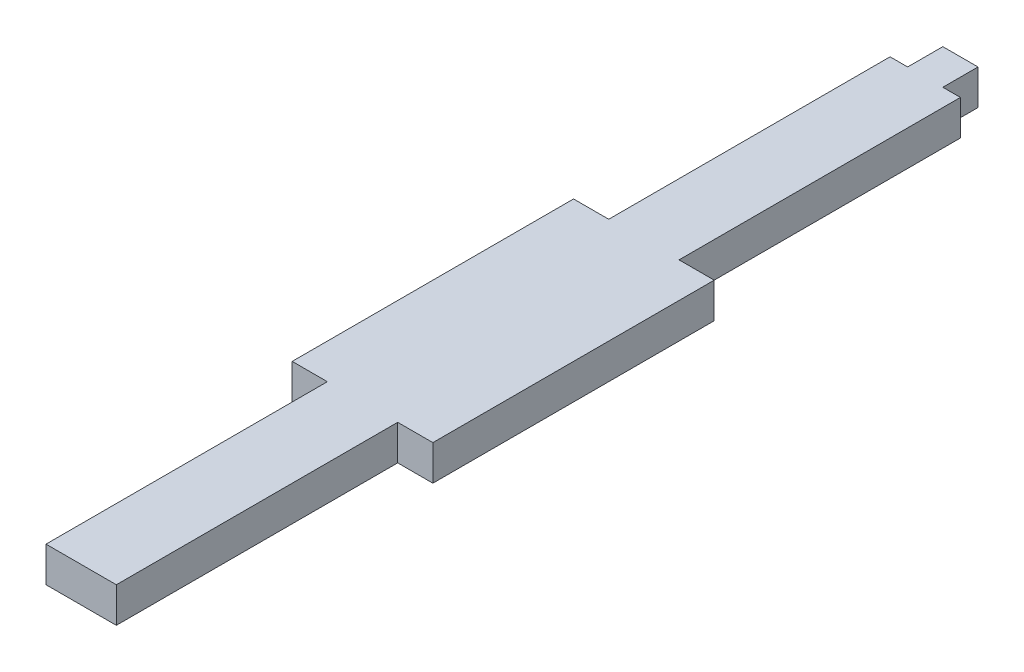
ISO-10303-21;
HEADER;
FILE_DESCRIPTION(('STEP AP214'),'2;1');
FILE_NAME('part.step','',(''),(''),'','','');
FILE_SCHEMA(('AUTOMOTIVE_DESIGN { 1 0 10303 214 1 1 1 1 }'));
ENDSEC;
DATA;
#1=APPLICATION_CONTEXT('core data for automotive mechanical design processes');
#2=APPLICATION_PROTOCOL_DEFINITION('international standard','automotive_design',2000,#1);
#3=PRODUCT_CONTEXT('',#1,'mechanical');
#4=PRODUCT('Part','Part','',(#3));
#5=PRODUCT_RELATED_PRODUCT_CATEGORY('part','',(#4));
#6=PRODUCT_DEFINITION_FORMATION('','',#4);
#7=PRODUCT_DEFINITION_CONTEXT('part definition',#1,'design');
#8=PRODUCT_DEFINITION('design','',#6,#7);
#9=PRODUCT_DEFINITION_SHAPE('','',#8);
#10=(LENGTH_UNIT() NAMED_UNIT(*) SI_UNIT(.MILLI.,.METRE.));
#11=(NAMED_UNIT(*) PLANE_ANGLE_UNIT() SI_UNIT($,.RADIAN.));
#12=(NAMED_UNIT(*) SI_UNIT($,.STERADIAN.) SOLID_ANGLE_UNIT());
#13=UNCERTAINTY_MEASURE_WITH_UNIT(LENGTH_MEASURE(1.E-05),#10,'distance_accuracy_value','');
#14=(GEOMETRIC_REPRESENTATION_CONTEXT(3) GLOBAL_UNCERTAINTY_ASSIGNED_CONTEXT((#13)) GLOBAL_UNIT_ASSIGNED_CONTEXT((#10,
#11,#12)) REPRESENTATION_CONTEXT('',''));
#15=CARTESIAN_POINT('',(0.,0.,0.));
#16=DIRECTION('',(0.,0.,1.));
#17=DIRECTION('',(1.,0.,0.));
#18=AXIS2_PLACEMENT_3D('',#15,#16,#17);
#19=CARTESIAN_POINT('',(3.175,3.175,79.375));
#20=DIRECTION('',(-1.,0.,0.));
#21=DIRECTION('',(0.,0.,1.));
#22=AXIS2_PLACEMENT_3D('',#19,#20,#21);
#23=PLANE('',#22);
#24=DIRECTION('',(0.,0.,-1.));
#25=VECTOR('',#24,1.);
#26=CARTESIAN_POINT('',(3.175,0.,79.375));
#27=LINE('',#26,#25);
#28=CARTESIAN_POINT('',(3.175,0.,79.375));
#29=VERTEX_POINT('',#28);
#30=CARTESIAN_POINT('',(3.175,0.,53.975));
#31=VERTEX_POINT('',#30);
#32=EDGE_CURVE('E176',#29,#31,#27,.T.);
#33=ORIENTED_EDGE('',*,*,#32,.T.);
#34=DIRECTION('',(0.,-1.,0.));
#35=VECTOR('',#34,1.);
#36=CARTESIAN_POINT('',(3.175,3.175,53.975));
#37=LINE('',#36,#35);
#38=CARTESIAN_POINT('',(3.175,3.175,53.975));
#39=VERTEX_POINT('',#38);
#40=EDGE_CURVE('E11',#39,#31,#37,.T.);
#41=ORIENTED_EDGE('',*,*,#40,.F.);
#42=DIRECTION('',(0.,0.,-1.));
#43=VECTOR('',#42,1.);
#44=CARTESIAN_POINT('',(3.175,3.175,79.375));
#45=LINE('',#44,#43);
#46=CARTESIAN_POINT('',(3.175,3.175,79.375));
#47=VERTEX_POINT('',#46);
#48=EDGE_CURVE('E207',#47,#39,#45,.T.);
#49=ORIENTED_EDGE('',*,*,#48,.F.);
#50=DIRECTION('',(0.,-1.,0.));
#51=VECTOR('',#50,1.);
#52=CARTESIAN_POINT('',(3.175,3.175,79.375));
#53=LINE('',#52,#51);
#54=EDGE_CURVE('E172',#47,#29,#53,.T.);
#55=ORIENTED_EDGE('',*,*,#54,.T.);
#56=EDGE_LOOP('',(#33,#41,#49,#55));
#57=FACE_BOUND('',#56,.T.);
#58=ADVANCED_FACE('F32',(#57),#23,.F.);
#59=CARTESIAN_POINT('',(6.35,3.175,53.975));
#60=DIRECTION('',(0.,0.,-1.));
#61=DIRECTION('',(-1.,0.,0.));
#62=AXIS2_PLACEMENT_3D('',#59,#60,#61);
#63=PLANE('',#62);
#64=DIRECTION('',(1.,0.,0.));
#65=VECTOR('',#64,1.);
#66=CARTESIAN_POINT('',(6.35,0.,53.975));
#67=LINE('',#66,#65);
#68=CARTESIAN_POINT('',(6.35,0.,53.975));
#69=VERTEX_POINT('',#68);
#70=EDGE_CURVE('E179',#31,#69,#67,.T.);
#71=ORIENTED_EDGE('',*,*,#70,.T.);
#72=DIRECTION('',(0.,-1.,0.));
#73=VECTOR('',#72,1.);
#74=CARTESIAN_POINT('',(6.35,3.175,53.975));
#75=LINE('',#74,#73);
#76=CARTESIAN_POINT('',(6.35,3.175,53.975));
#77=VERTEX_POINT('',#76);
#78=EDGE_CURVE('E40',#77,#69,#75,.T.);
#79=ORIENTED_EDGE('',*,*,#78,.F.);
#80=DIRECTION('',(1.,0.,0.));
#81=VECTOR('',#80,1.);
#82=CARTESIAN_POINT('',(6.35,3.175,53.975));
#83=LINE('',#82,#81);
#84=EDGE_CURVE('E115',#39,#77,#83,.T.);
#85=ORIENTED_EDGE('',*,*,#84,.F.);
#86=ORIENTED_EDGE('',*,*,#40,.T.);
#87=EDGE_LOOP('',(#71,#79,#85,#86));
#88=FACE_BOUND('',#87,.T.);
#89=ADVANCED_FACE('F305',(#88),#63,.F.);
#90=CARTESIAN_POINT('',(6.35,3.175,53.975));
#91=DIRECTION('',(-1.,0.,0.));
#92=DIRECTION('',(0.,0.,1.));
#93=AXIS2_PLACEMENT_3D('',#90,#91,#92);
#94=PLANE('',#93);
#95=DIRECTION('',(0.,0.,-1.));
#96=VECTOR('',#95,1.);
#97=CARTESIAN_POINT('',(6.35,0.,53.975));
#98=LINE('',#97,#96);
#99=CARTESIAN_POINT('',(6.34999999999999,0.,28.575));
#100=VERTEX_POINT('',#99);
#101=EDGE_CURVE('E181',#69,#100,#98,.T.);
#102=ORIENTED_EDGE('',*,*,#101,.T.);
#103=DIRECTION('',(0.,-1.,0.));
#104=VECTOR('',#103,1.);
#105=CARTESIAN_POINT('',(6.34999999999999,3.175,28.575));
#106=LINE('',#105,#104);
#107=CARTESIAN_POINT('',(6.34999999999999,3.175,28.575));
#108=VERTEX_POINT('',#107);
#109=EDGE_CURVE('E238',#108,#100,#106,.T.);
#110=ORIENTED_EDGE('',*,*,#109,.F.);
#111=DIRECTION('',(0.,0.,-1.));
#112=VECTOR('',#111,1.);
#113=CARTESIAN_POINT('',(6.35,3.175,53.975));
#114=LINE('',#113,#112);
#115=EDGE_CURVE('E246',#77,#108,#114,.T.);
#116=ORIENTED_EDGE('',*,*,#115,.F.);
#117=ORIENTED_EDGE('',*,*,#78,.T.);
#118=EDGE_LOOP('',(#102,#110,#116,#117));
#119=FACE_BOUND('',#118,.T.);
#120=ADVANCED_FACE('F244',(#119),#94,.F.);
#121=CARTESIAN_POINT('',(6.34999999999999,3.175,28.575));
#122=DIRECTION('',(0.,0.,1.));
#123=DIRECTION('',(1.,0.,0.));
#124=AXIS2_PLACEMENT_3D('',#121,#122,#123);
#125=PLANE('',#124);
#126=DIRECTION('',(-1.,0.,0.));
#127=VECTOR('',#126,1.);
#128=CARTESIAN_POINT('',(6.34999999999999,0.,28.575));
#129=LINE('',#128,#127);
#130=CARTESIAN_POINT('',(3.175,0.,28.575));
#131=VERTEX_POINT('',#130);
#132=EDGE_CURVE('E183',#100,#131,#129,.T.);
#133=ORIENTED_EDGE('',*,*,#132,.T.);
#134=DIRECTION('',(0.,-1.,0.));
#135=VECTOR('',#134,1.);
#136=CARTESIAN_POINT('',(3.175,3.175,28.575));
#137=LINE('',#136,#135);
#138=CARTESIAN_POINT('',(3.175,3.175,28.575));
#139=VERTEX_POINT('',#138);
#140=EDGE_CURVE('E235',#139,#131,#137,.T.);
#141=ORIENTED_EDGE('',*,*,#140,.F.);
#142=DIRECTION('',(-1.,0.,0.));
#143=VECTOR('',#142,1.);
#144=CARTESIAN_POINT('',(6.34999999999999,3.175,28.575));
#145=LINE('',#144,#143);
#146=EDGE_CURVE('E264',#108,#139,#145,.T.);
#147=ORIENTED_EDGE('',*,*,#146,.F.);
#148=ORIENTED_EDGE('',*,*,#109,.T.);
#149=EDGE_LOOP('',(#133,#141,#147,#148));
#150=FACE_BOUND('',#149,.T.);
#151=ADVANCED_FACE('F255',(#150),#125,.F.);
#152=CARTESIAN_POINT('',(3.175,3.175,3.17500000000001));
#153=DIRECTION('',(-1.,0.,0.));
#154=DIRECTION('',(0.,0.,1.));
#155=AXIS2_PLACEMENT_3D('',#152,#153,#154);
#156=PLANE('',#155);
#157=DIRECTION('',(0.,0.,-1.));
#158=VECTOR('',#157,1.);
#159=CARTESIAN_POINT('',(3.175,0.,3.17500000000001));
#160=LINE('',#159,#158);
#161=CARTESIAN_POINT('',(3.175,0.,3.17500000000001));
#162=VERTEX_POINT('',#161);
#163=EDGE_CURVE('E185',#131,#162,#160,.T.);
#164=ORIENTED_EDGE('',*,*,#163,.T.);
#165=DIRECTION('',(0.,-1.,0.));
#166=VECTOR('',#165,1.);
#167=CARTESIAN_POINT('',(3.175,3.175,3.17500000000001));
#168=LINE('',#167,#166);
#169=CARTESIAN_POINT('',(3.175,3.175,3.17500000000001));
#170=VERTEX_POINT('',#169);
#171=EDGE_CURVE('E232',#170,#162,#168,.T.);
#172=ORIENTED_EDGE('',*,*,#171,.F.);
#173=DIRECTION('',(0.,0.,-1.));
#174=VECTOR('',#173,1.);
#175=CARTESIAN_POINT('',(3.175,3.175,3.17500000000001));
#176=LINE('',#175,#174);
#177=EDGE_CURVE('E261',#139,#170,#176,.T.);
#178=ORIENTED_EDGE('',*,*,#177,.F.);
#179=ORIENTED_EDGE('',*,*,#140,.T.);
#180=EDGE_LOOP('',(#164,#172,#178,#179));
#181=FACE_BOUND('',#180,.T.);
#182=ADVANCED_FACE('F259',(#181),#156,.F.);
#183=CARTESIAN_POINT('',(1.5875,3.175,3.175));
#184=DIRECTION('',(0.,0.,1.));
#185=DIRECTION('',(1.,0.,0.));
#186=AXIS2_PLACEMENT_3D('',#183,#184,#185);
#187=PLANE('',#186);
#188=DIRECTION('',(-1.,0.,0.));
#189=VECTOR('',#188,1.);
#190=CARTESIAN_POINT('',(1.5875,0.,3.175));
#191=LINE('',#190,#189);
#192=CARTESIAN_POINT('',(1.5875,0.,3.175));
#193=VERTEX_POINT('',#192);
#194=EDGE_CURVE('E187',#162,#193,#191,.T.);
#195=ORIENTED_EDGE('',*,*,#194,.T.);
#196=DIRECTION('',(0.,-1.,0.));
#197=VECTOR('',#196,1.);
#198=CARTESIAN_POINT('',(1.5875,3.175,3.175));
#199=LINE('',#198,#197);
#200=CARTESIAN_POINT('',(1.5875,3.175,3.175));
#201=VERTEX_POINT('',#200);
#202=EDGE_CURVE('E229',#201,#193,#199,.T.);
#203=ORIENTED_EDGE('',*,*,#202,.F.);
#204=DIRECTION('',(-1.,0.,0.));
#205=VECTOR('',#204,1.);
#206=CARTESIAN_POINT('',(1.5875,3.175,3.175));
#207=LINE('',#206,#205);
#208=EDGE_CURVE('E263',#170,#201,#207,.T.);
#209=ORIENTED_EDGE('',*,*,#208,.F.);
#210=ORIENTED_EDGE('',*,*,#171,.T.);
#211=EDGE_LOOP('',(#195,#203,#209,#210));
#212=FACE_BOUND('',#211,.T.);
#213=ADVANCED_FACE('F318',(#212),#187,.F.);
#214=CARTESIAN_POINT('',(1.5875,3.175,0.));
#215=DIRECTION('',(-1.,0.,0.));
#216=DIRECTION('',(0.,0.,1.));
#217=AXIS2_PLACEMENT_3D('',#214,#215,#216);
#218=PLANE('',#217);
#219=DIRECTION('',(0.,0.,-1.));
#220=VECTOR('',#219,1.);
#221=CARTESIAN_POINT('',(1.5875,0.,0.));
#222=LINE('',#221,#220);
#223=CARTESIAN_POINT('',(1.5875,0.,0.));
#224=VERTEX_POINT('',#223);
#225=EDGE_CURVE('E189',#193,#224,#222,.T.);
#226=ORIENTED_EDGE('',*,*,#225,.T.);
#227=DIRECTION('',(0.,-1.,0.));
#228=VECTOR('',#227,1.);
#229=CARTESIAN_POINT('',(1.5875,3.175,0.));
#230=LINE('',#229,#228);
#231=CARTESIAN_POINT('',(1.5875,3.175,0.));
#232=VERTEX_POINT('',#231);
#233=EDGE_CURVE('E226',#232,#224,#230,.T.);
#234=ORIENTED_EDGE('',*,*,#233,.F.);
#235=DIRECTION('',(0.,0.,-1.));
#236=VECTOR('',#235,1.);
#237=CARTESIAN_POINT('',(1.5875,3.175,0.));
#238=LINE('',#237,#236);
#239=EDGE_CURVE('E266',#201,#232,#238,.T.);
#240=ORIENTED_EDGE('',*,*,#239,.F.);
#241=ORIENTED_EDGE('',*,*,#202,.T.);
#242=EDGE_LOOP('',(#226,#234,#240,#241));
#243=FACE_BOUND('',#242,.T.);
#244=ADVANCED_FACE('F321',(#243),#218,.F.);
#245=CARTESIAN_POINT('',(0.,3.175,0.));
#246=DIRECTION('',(0.,0.,1.));
#247=DIRECTION('',(1.,0.,0.));
#248=AXIS2_PLACEMENT_3D('',#245,#246,#247);
#249=PLANE('',#248);
#250=DIRECTION('',(-1.,0.,0.));
#251=VECTOR('',#250,1.);
#252=CARTESIAN_POINT('',(0.,0.,0.));
#253=LINE('',#252,#251);
#254=CARTESIAN_POINT('',(-1.5875,0.,0.));
#255=VERTEX_POINT('',#254);
#256=EDGE_CURVE('E192',#224,#255,#253,.T.);
#257=ORIENTED_EDGE('',*,*,#256,.T.);
#258=DIRECTION('',(0.,-1.,0.));
#259=VECTOR('',#258,1.);
#260=CARTESIAN_POINT('',(-1.5875,3.175,0.));
#261=LINE('',#260,#259);
#262=CARTESIAN_POINT('',(-1.5875,3.175,0.));
#263=VERTEX_POINT('',#262);
#264=EDGE_CURVE('E223',#263,#255,#261,.T.);
#265=ORIENTED_EDGE('',*,*,#264,.F.);
#266=DIRECTION('',(-1.,0.,0.));
#267=VECTOR('',#266,1.);
#268=CARTESIAN_POINT('',(0.,3.175,0.));
#269=LINE('',#268,#267);
#270=EDGE_CURVE('E272',#232,#263,#269,.T.);
#271=ORIENTED_EDGE('',*,*,#270,.F.);
#272=ORIENTED_EDGE('',*,*,#233,.T.);
#273=EDGE_LOOP('',(#257,#265,#271,#272));
#274=FACE_BOUND('',#273,.T.);
#275=ADVANCED_FACE('F325',(#274),#249,.F.);
#276=CARTESIAN_POINT('',(-1.5875,3.175,0.));
#277=DIRECTION('',(1.,0.,0.));
#278=DIRECTION('',(0.,0.,-1.));
#279=AXIS2_PLACEMENT_3D('',#276,#277,#278);
#280=PLANE('',#279);
#281=DIRECTION('',(0.,0.,1.));
#282=VECTOR('',#281,1.);
#283=CARTESIAN_POINT('',(-1.5875,0.,0.));
#284=LINE('',#283,#282);
#285=CARTESIAN_POINT('',(-1.5875,0.,3.175));
#286=VERTEX_POINT('',#285);
#287=EDGE_CURVE('E194',#255,#286,#284,.T.);
#288=ORIENTED_EDGE('',*,*,#287,.T.);
#289=DIRECTION('',(0.,-1.,0.));
#290=VECTOR('',#289,1.);
#291=CARTESIAN_POINT('',(-1.5875,3.175,3.175));
#292=LINE('',#291,#290);
#293=CARTESIAN_POINT('',(-1.5875,3.175,3.175));
#294=VERTEX_POINT('',#293);
#295=EDGE_CURVE('E220',#294,#286,#292,.T.);
#296=ORIENTED_EDGE('',*,*,#295,.F.);
#297=DIRECTION('',(0.,0.,1.));
#298=VECTOR('',#297,1.);
#299=CARTESIAN_POINT('',(-1.5875,3.175,0.));
#300=LINE('',#299,#298);
#301=EDGE_CURVE('E274',#263,#294,#300,.T.);
#302=ORIENTED_EDGE('',*,*,#301,.F.);
#303=ORIENTED_EDGE('',*,*,#264,.T.);
#304=EDGE_LOOP('',(#288,#296,#302,#303));
#305=FACE_BOUND('',#304,.T.);
#306=ADVANCED_FACE('F329',(#305),#280,.F.);
#307=CARTESIAN_POINT('',(-3.175,3.175,3.175));
#308=DIRECTION('',(0.,0.,1.));
#309=DIRECTION('',(1.,0.,0.));
#310=AXIS2_PLACEMENT_3D('',#307,#308,#309);
#311=PLANE('',#310);
#312=DIRECTION('',(-1.,0.,0.));
#313=VECTOR('',#312,1.);
#314=CARTESIAN_POINT('',(-3.175,0.,3.175));
#315=LINE('',#314,#313);
#316=CARTESIAN_POINT('',(-3.175,0.,3.175));
#317=VERTEX_POINT('',#316);
#318=EDGE_CURVE('E196',#286,#317,#315,.T.);
#319=ORIENTED_EDGE('',*,*,#318,.T.);
#320=DIRECTION('',(0.,-1.,0.));
#321=VECTOR('',#320,1.);
#322=CARTESIAN_POINT('',(-3.175,3.175,3.175));
#323=LINE('',#322,#321);
#324=CARTESIAN_POINT('',(-3.175,3.175,3.175));
#325=VERTEX_POINT('',#324);
#326=EDGE_CURVE('E217',#325,#317,#323,.T.);
#327=ORIENTED_EDGE('',*,*,#326,.F.);
#328=DIRECTION('',(-1.,0.,0.));
#329=VECTOR('',#328,1.);
#330=CARTESIAN_POINT('',(-3.175,3.175,3.175));
#331=LINE('',#330,#329);
#332=EDGE_CURVE('E276',#294,#325,#331,.T.);
#333=ORIENTED_EDGE('',*,*,#332,.F.);
#334=ORIENTED_EDGE('',*,*,#295,.T.);
#335=EDGE_LOOP('',(#319,#327,#333,#334));
#336=FACE_BOUND('',#335,.T.);
#337=ADVANCED_FACE('F333',(#336),#311,.F.);
#338=CARTESIAN_POINT('',(-3.175,3.175,3.175));
#339=DIRECTION('',(1.,0.,0.));
#340=DIRECTION('',(0.,0.,-1.));
#341=AXIS2_PLACEMENT_3D('',#338,#339,#340);
#342=PLANE('',#341);
#343=DIRECTION('',(0.,0.,1.));
#344=VECTOR('',#343,1.);
#345=CARTESIAN_POINT('',(-3.175,0.,3.175));
#346=LINE('',#345,#344);
#347=CARTESIAN_POINT('',(-3.175,0.,28.575));
#348=VERTEX_POINT('',#347);
#349=EDGE_CURVE('E198',#317,#348,#346,.T.);
#350=ORIENTED_EDGE('',*,*,#349,.T.);
#351=DIRECTION('',(0.,-1.,0.));
#352=VECTOR('',#351,1.);
#353=CARTESIAN_POINT('',(-3.175,3.175,28.575));
#354=LINE('',#353,#352);
#355=CARTESIAN_POINT('',(-3.175,3.175,28.575));
#356=VERTEX_POINT('',#355);
#357=EDGE_CURVE('E214',#356,#348,#354,.T.);
#358=ORIENTED_EDGE('',*,*,#357,.F.);
#359=DIRECTION('',(0.,0.,1.));
#360=VECTOR('',#359,1.);
#361=CARTESIAN_POINT('',(-3.175,3.175,3.175));
#362=LINE('',#361,#360);
#363=EDGE_CURVE('E278',#325,#356,#362,.T.);
#364=ORIENTED_EDGE('',*,*,#363,.F.);
#365=ORIENTED_EDGE('',*,*,#326,.T.);
#366=EDGE_LOOP('',(#350,#358,#364,#365));
#367=FACE_BOUND('',#366,.T.);
#368=ADVANCED_FACE('F337',(#367),#342,.F.);
#369=CARTESIAN_POINT('',(-6.35,3.175,28.575));
#370=DIRECTION('',(0.,0.,1.));
#371=DIRECTION('',(1.,0.,0.));
#372=AXIS2_PLACEMENT_3D('',#369,#370,#371);
#373=PLANE('',#372);
#374=DIRECTION('',(-1.,0.,0.));
#375=VECTOR('',#374,1.);
#376=CARTESIAN_POINT('',(-6.35,0.,28.575));
#377=LINE('',#376,#375);
#378=CARTESIAN_POINT('',(-6.35,0.,28.575));
#379=VERTEX_POINT('',#378);
#380=EDGE_CURVE('E200',#348,#379,#377,.T.);
#381=ORIENTED_EDGE('',*,*,#380,.T.);
#382=DIRECTION('',(0.,-1.,0.));
#383=VECTOR('',#382,1.);
#384=CARTESIAN_POINT('',(-6.35,3.175,28.575));
#385=LINE('',#384,#383);
#386=CARTESIAN_POINT('',(-6.35,3.175,28.575));
#387=VERTEX_POINT('',#386);
#388=EDGE_CURVE('E211',#387,#379,#385,.T.);
#389=ORIENTED_EDGE('',*,*,#388,.F.);
#390=DIRECTION('',(-1.,0.,0.));
#391=VECTOR('',#390,1.);
#392=CARTESIAN_POINT('',(-6.35,3.175,28.575));
#393=LINE('',#392,#391);
#394=EDGE_CURVE('E280',#356,#387,#393,.T.);
#395=ORIENTED_EDGE('',*,*,#394,.F.);
#396=ORIENTED_EDGE('',*,*,#357,.T.);
#397=EDGE_LOOP('',(#381,#389,#395,#396));
#398=FACE_BOUND('',#397,.T.);
#399=ADVANCED_FACE('F286',(#398),#373,.F.);
#400=CARTESIAN_POINT('',(-6.35,3.175,53.975));
#401=DIRECTION('',(1.,0.,0.));
#402=DIRECTION('',(0.,0.,-1.));
#403=AXIS2_PLACEMENT_3D('',#400,#401,#402);
#404=PLANE('',#403);
#405=DIRECTION('',(0.,0.,1.));
#406=VECTOR('',#405,1.);
#407=CARTESIAN_POINT('',(-6.35,0.,53.975));
#408=LINE('',#407,#406);
#409=CARTESIAN_POINT('',(-6.35,0.,53.975));
#410=VERTEX_POINT('',#409);
#411=EDGE_CURVE('E202',#379,#410,#408,.T.);
#412=ORIENTED_EDGE('',*,*,#411,.T.);
#413=DIRECTION('',(0.,-1.,0.));
#414=VECTOR('',#413,1.);
#415=CARTESIAN_POINT('',(-6.35,3.175,53.975));
#416=LINE('',#415,#414);
#417=CARTESIAN_POINT('',(-6.35,3.175,53.975));
#418=VERTEX_POINT('',#417);
#419=EDGE_CURVE('E167',#418,#410,#416,.T.);
#420=ORIENTED_EDGE('',*,*,#419,.F.);
#421=DIRECTION('',(0.,0.,1.));
#422=VECTOR('',#421,1.);
#423=CARTESIAN_POINT('',(-6.35,3.175,53.975));
#424=LINE('',#423,#422);
#425=EDGE_CURVE('E158',#387,#418,#424,.T.);
#426=ORIENTED_EDGE('',*,*,#425,.F.);
#427=ORIENTED_EDGE('',*,*,#388,.T.);
#428=EDGE_LOOP('',(#412,#420,#426,#427));
#429=FACE_BOUND('',#428,.T.);
#430=ADVANCED_FACE('F290',(#429),#404,.F.);
#431=CARTESIAN_POINT('',(-6.35,3.175,53.975));
#432=DIRECTION('',(0.,0.,-1.));
#433=DIRECTION('',(-1.,0.,0.));
#434=AXIS2_PLACEMENT_3D('',#431,#432,#433);
#435=PLANE('',#434);
#436=DIRECTION('',(1.,0.,0.));
#437=VECTOR('',#436,1.);
#438=CARTESIAN_POINT('',(-6.35,0.,53.975));
#439=LINE('',#438,#437);
#440=CARTESIAN_POINT('',(-3.175,0.,53.975));
#441=VERTEX_POINT('',#440);
#442=EDGE_CURVE('E166',#410,#441,#439,.T.);
#443=ORIENTED_EDGE('',*,*,#442,.T.);
#444=DIRECTION('',(0.,-1.,0.));
#445=VECTOR('',#444,1.);
#446=CARTESIAN_POINT('',(-3.175,3.175,53.975));
#447=LINE('',#446,#445);
#448=CARTESIAN_POINT('',(-3.175,3.175,53.975));
#449=VERTEX_POINT('',#448);
#450=EDGE_CURVE('E163',#449,#441,#447,.T.);
#451=ORIENTED_EDGE('',*,*,#450,.F.);
#452=DIRECTION('',(1.,0.,0.));
#453=VECTOR('',#452,1.);
#454=CARTESIAN_POINT('',(-6.35,3.175,53.975));
#455=LINE('',#454,#453);
#456=EDGE_CURVE('E152',#418,#449,#455,.T.);
#457=ORIENTED_EDGE('',*,*,#456,.F.);
#458=ORIENTED_EDGE('',*,*,#419,.T.);
#459=EDGE_LOOP('',(#443,#451,#457,#458));
#460=FACE_BOUND('',#459,.T.);
#461=ADVANCED_FACE('F164',(#460),#435,.F.);
#462=CARTESIAN_POINT('',(-3.175,3.175,79.375));
#463=DIRECTION('',(1.,0.,0.));
#464=DIRECTION('',(0.,0.,-1.));
#465=AXIS2_PLACEMENT_3D('',#462,#463,#464);
#466=PLANE('',#465);
#467=DIRECTION('',(0.,0.,1.));
#468=VECTOR('',#467,1.);
#469=CARTESIAN_POINT('',(-3.175,0.,79.375));
#470=LINE('',#469,#468);
#471=CARTESIAN_POINT('',(-3.175,0.,79.375));
#472=VERTEX_POINT('',#471);
#473=EDGE_CURVE('E101',#441,#472,#470,.T.);
#474=ORIENTED_EDGE('',*,*,#473,.T.);
#475=DIRECTION('',(0.,-1.,0.));
#476=VECTOR('',#475,1.);
#477=CARTESIAN_POINT('',(-3.175,3.175,79.375));
#478=LINE('',#477,#476);
#479=CARTESIAN_POINT('',(-3.175,3.175,79.375));
#480=VERTEX_POINT('',#479);
#481=EDGE_CURVE('E168',#480,#472,#478,.T.);
#482=ORIENTED_EDGE('',*,*,#481,.F.);
#483=DIRECTION('',(0.,0.,1.));
#484=VECTOR('',#483,1.);
#485=CARTESIAN_POINT('',(-3.175,3.175,79.375));
#486=LINE('',#485,#484);
#487=EDGE_CURVE('E156',#449,#480,#486,.T.);
#488=ORIENTED_EDGE('',*,*,#487,.F.);
#489=ORIENTED_EDGE('',*,*,#450,.T.);
#490=EDGE_LOOP('',(#474,#482,#488,#489));
#491=FACE_BOUND('',#490,.T.);
#492=ADVANCED_FACE('F170',(#491),#466,.F.);
#493=CARTESIAN_POINT('',(3.175,3.175,79.375));
#494=DIRECTION('',(0.,0.,-1.));
#495=DIRECTION('',(-1.,0.,0.));
#496=AXIS2_PLACEMENT_3D('',#493,#494,#495);
#497=PLANE('',#496);
#498=DIRECTION('',(1.,0.,0.));
#499=VECTOR('',#498,1.);
#500=CARTESIAN_POINT('',(3.175,0.,79.375));
#501=LINE('',#500,#499);
#502=EDGE_CURVE('E107',#472,#29,#501,.T.);
#503=ORIENTED_EDGE('',*,*,#502,.T.);
#504=ORIENTED_EDGE('',*,*,#54,.F.);
#505=DIRECTION('',(1.,0.,0.));
#506=VECTOR('',#505,1.);
#507=CARTESIAN_POINT('',(3.175,3.175,79.375));
#508=LINE('',#507,#506);
#509=EDGE_CURVE('E48',#480,#47,#508,.T.);
#510=ORIENTED_EDGE('',*,*,#509,.F.);
#511=ORIENTED_EDGE('',*,*,#481,.T.);
#512=EDGE_LOOP('',(#503,#504,#510,#511));
#513=FACE_BOUND('',#512,.T.);
#514=ADVANCED_FACE('F294',(#513),#497,.F.);
#515=CARTESIAN_POINT('',(3.175,3.175,53.975));
#516=DIRECTION('',(0.,1.,0.));
#517=DIRECTION('',(0.,0.,1.));
#518=AXIS2_PLACEMENT_3D('',#515,#516,#517);
#519=PLANE('',#518);
#520=ORIENTED_EDGE('',*,*,#48,.T.);
#521=ORIENTED_EDGE('',*,*,#84,.T.);
#522=ORIENTED_EDGE('',*,*,#115,.T.);
#523=ORIENTED_EDGE('',*,*,#146,.T.);
#524=ORIENTED_EDGE('',*,*,#177,.T.);
#525=ORIENTED_EDGE('',*,*,#208,.T.);
#526=ORIENTED_EDGE('',*,*,#239,.T.);
#527=ORIENTED_EDGE('',*,*,#270,.T.);
#528=ORIENTED_EDGE('',*,*,#301,.T.);
#529=ORIENTED_EDGE('',*,*,#332,.T.);
#530=ORIENTED_EDGE('',*,*,#363,.T.);
#531=ORIENTED_EDGE('',*,*,#394,.T.);
#532=ORIENTED_EDGE('',*,*,#425,.T.);
#533=ORIENTED_EDGE('',*,*,#456,.T.);
#534=ORIENTED_EDGE('',*,*,#487,.T.);
#535=ORIENTED_EDGE('',*,*,#509,.T.);
#536=EDGE_LOOP('',(#520,#521,#522,#523,#524,#525,#526,#527,#528,#529,#530,#531,#532,#533,#534,#535));
#537=FACE_BOUND('',#536,.T.);
#538=ADVANCED_FACE('F154',(#537),#519,.T.);
#539=CARTESIAN_POINT('',(3.175,0.,53.975));
#540=DIRECTION('',(0.,1.,0.));
#541=DIRECTION('',(0.,0.,1.));
#542=AXIS2_PLACEMENT_3D('',#539,#540,#541);
#543=PLANE('',#542);
#544=ORIENTED_EDGE('',*,*,#32,.F.);
#545=ORIENTED_EDGE('',*,*,#502,.F.);
#546=ORIENTED_EDGE('',*,*,#473,.F.);
#547=ORIENTED_EDGE('',*,*,#442,.F.);
#548=ORIENTED_EDGE('',*,*,#411,.F.);
#549=ORIENTED_EDGE('',*,*,#380,.F.);
#550=ORIENTED_EDGE('',*,*,#349,.F.);
#551=ORIENTED_EDGE('',*,*,#318,.F.);
#552=ORIENTED_EDGE('',*,*,#287,.F.);
#553=ORIENTED_EDGE('',*,*,#256,.F.);
#554=ORIENTED_EDGE('',*,*,#225,.F.);
#555=ORIENTED_EDGE('',*,*,#194,.F.);
#556=ORIENTED_EDGE('',*,*,#163,.F.);
#557=ORIENTED_EDGE('',*,*,#132,.F.);
#558=ORIENTED_EDGE('',*,*,#101,.F.);
#559=ORIENTED_EDGE('',*,*,#70,.F.);
#560=EDGE_LOOP('',(#544,#545,#546,#547,#548,#549,#550,#551,#552,#553,#554,#555,#556,#557,#558,#559));
#561=FACE_BOUND('',#560,.T.);
#562=ADVANCED_FACE('F250',(#561),#543,.F.);
#563=CLOSED_SHELL('',(#58,#89,#120,#151,#182,#213,#244,#275,#306,#337,#368,#399,#430,#461,#492,
#514,#538,#562));
#564=MANIFOLD_SOLID_BREP('B2',#563);
#565=ADVANCED_BREP_SHAPE_REPRESENTATION('',(#18,#564),#14);
#566=SHAPE_DEFINITION_REPRESENTATION(#9,#565);
ENDSEC;
END-ISO-10303-21;
